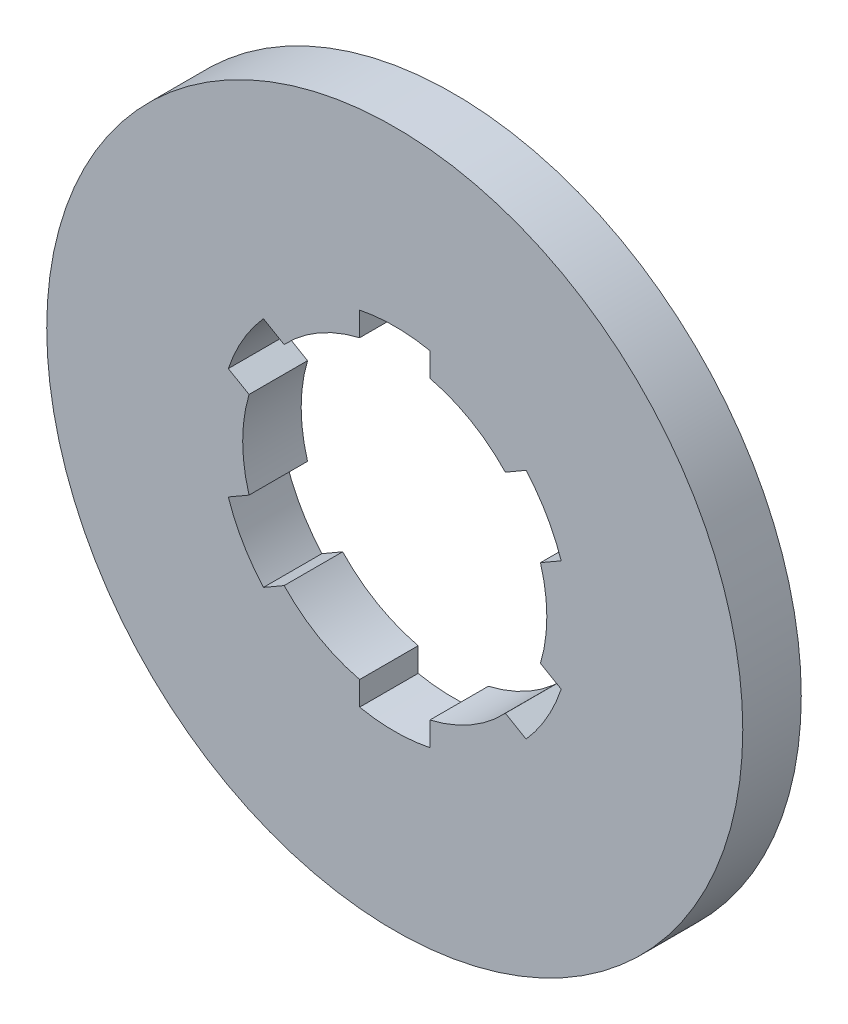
ISO-10303-21;
HEADER;
FILE_DESCRIPTION(('STEP AP214'),'2;1');
FILE_NAME('part.step','',(''),(''),'','','');
FILE_SCHEMA(('AUTOMOTIVE_DESIGN { 1 0 10303 214 1 1 1 1 }'));
ENDSEC;
DATA;
#1=APPLICATION_CONTEXT('core data for automotive mechanical design processes');
#2=APPLICATION_PROTOCOL_DEFINITION('international standard','automotive_design',2000,#1);
#3=PRODUCT_CONTEXT('',#1,'mechanical');
#4=PRODUCT('Part','Part','',(#3));
#5=PRODUCT_RELATED_PRODUCT_CATEGORY('part','',(#4));
#6=PRODUCT_DEFINITION_FORMATION('','',#4);
#7=PRODUCT_DEFINITION_CONTEXT('part definition',#1,'design');
#8=PRODUCT_DEFINITION('design','',#6,#7);
#9=PRODUCT_DEFINITION_SHAPE('','',#8);
#10=(LENGTH_UNIT() NAMED_UNIT(*) SI_UNIT(.MILLI.,.METRE.));
#11=(NAMED_UNIT(*) PLANE_ANGLE_UNIT() SI_UNIT($,.RADIAN.));
#12=(NAMED_UNIT(*) SI_UNIT($,.STERADIAN.) SOLID_ANGLE_UNIT());
#13=UNCERTAINTY_MEASURE_WITH_UNIT(LENGTH_MEASURE(1.E-05),#10,'distance_accuracy_value','');
#14=(GEOMETRIC_REPRESENTATION_CONTEXT(3) GLOBAL_UNCERTAINTY_ASSIGNED_CONTEXT((#13)) GLOBAL_UNIT_ASSIGNED_CONTEXT((#10,
#11,#12)) REPRESENTATION_CONTEXT('',''));
#15=CARTESIAN_POINT('',(0.,0.,0.));
#16=DIRECTION('',(0.,0.,1.));
#17=DIRECTION('',(1.,0.,0.));
#18=AXIS2_PLACEMENT_3D('',#15,#16,#17);
#19=CARTESIAN_POINT('',(0.,0.,-2.5));
#20=DIRECTION('',(0.,0.,1.));
#21=DIRECTION('',(1.,0.,0.));
#22=AXIS2_PLACEMENT_3D('',#19,#20,#21);
#23=CYLINDRICAL_SURFACE('',#22,13.);
#24=CARTESIAN_POINT('',(0.,0.,-2.5));
#25=DIRECTION('',(0.,0.,1.));
#26=DIRECTION('',(1.,0.,0.));
#27=AXIS2_PLACEMENT_3D('',#24,#25,#26);
#28=CIRCLE('',#27,13.);
#29=CARTESIAN_POINT('',(9.45445115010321,8.92263153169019,-2.5));
#30=VERTEX_POINT('',#29);
#31=CARTESIAN_POINT('',(3.,12.6491106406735,-2.5));
#32=VERTEX_POINT('',#31);
#33=EDGE_CURVE('E234',#30,#32,#28,.T.);
#34=ORIENTED_EDGE('',*,*,#33,.F.);
#35=DIRECTION('',(0.,0.,1.));
#36=VECTOR('',#35,1.);
#37=CARTESIAN_POINT('',(9.45445115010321,8.92263153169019,-2.5));
#38=LINE('',#37,#36);
#39=CARTESIAN_POINT('',(9.45445115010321,8.92263153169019,2.49999999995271));
#40=VERTEX_POINT('',#39);
#41=EDGE_CURVE('E337',#30,#40,#38,.T.);
#42=ORIENTED_EDGE('',*,*,#41,.T.);
#43=CARTESIAN_POINT('',(0.,0.,2.5));
#44=DIRECTION('',(0.,0.,1.));
#45=DIRECTION('',(1.,0.,0.));
#46=AXIS2_PLACEMENT_3D('',#43,#44,#45);
#47=CIRCLE('',#46,13.);
#48=CARTESIAN_POINT('',(3.,12.6491106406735,2.49999999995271));
#49=VERTEX_POINT('',#48);
#50=EDGE_CURVE('E225',#40,#49,#47,.T.);
#51=ORIENTED_EDGE('',*,*,#50,.T.);
#52=DIRECTION('',(0.,0.,1.));
#53=VECTOR('',#52,1.);
#54=CARTESIAN_POINT('',(3.,12.6491106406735,-2.5));
#55=LINE('',#54,#53);
#56=EDGE_CURVE('E236',#32,#49,#55,.T.);
#57=ORIENTED_EDGE('',*,*,#56,.F.);
#58=EDGE_LOOP('',(#34,#42,#51,#57));
#59=FACE_BOUND('',#58,.T.);
#60=ADVANCED_FACE('F36',(#59),#23,.F.);
#61=CARTESIAN_POINT('',(12.4544511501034,-3.72647910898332,2.49999999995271));
#62=VERTEX_POINT('',#61);
#63=CARTESIAN_POINT('',(12.4544511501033,3.72647910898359,2.49999999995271));
#64=VERTEX_POINT('',#63);
#65=EDGE_CURVE('E217',#62,#64,#47,.T.);
#66=ORIENTED_EDGE('',*,*,#65,.T.);
#67=DIRECTION('',(0.,0.,1.));
#68=VECTOR('',#67,1.);
#69=CARTESIAN_POINT('',(12.4544511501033,3.72647910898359,-2.5));
#70=LINE('',#69,#68);
#71=CARTESIAN_POINT('',(12.4544511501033,3.72647910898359,-2.5));
#72=VERTEX_POINT('',#71);
#73=EDGE_CURVE('E197',#72,#64,#70,.T.);
#74=ORIENTED_EDGE('',*,*,#73,.F.);
#75=CARTESIAN_POINT('',(12.4544511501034,-3.72647910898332,-2.5));
#76=VERTEX_POINT('',#75);
#77=EDGE_CURVE('E380',#76,#72,#28,.T.);
#78=ORIENTED_EDGE('',*,*,#77,.F.);
#79=DIRECTION('',(0.,0.,1.));
#80=VECTOR('',#79,1.);
#81=CARTESIAN_POINT('',(12.4544511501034,-3.72647910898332,-2.5));
#82=LINE('',#81,#80);
#83=EDGE_CURVE('E223',#76,#62,#82,.T.);
#84=ORIENTED_EDGE('',*,*,#83,.T.);
#85=EDGE_LOOP('',(#66,#74,#78,#84));
#86=FACE_BOUND('',#85,.T.);
#87=ADVANCED_FACE('F222',(#86),#23,.F.);
#88=CARTESIAN_POINT('',(3.00000000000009,-12.6491106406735,2.49999999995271));
#89=VERTEX_POINT('',#88);
#90=CARTESIAN_POINT('',(9.45445115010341,-8.92263153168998,2.49999999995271));
#91=VERTEX_POINT('',#90);
#92=EDGE_CURVE('E224',#89,#91,#47,.T.);
#93=ORIENTED_EDGE('',*,*,#92,.T.);
#94=DIRECTION('',(0.,0.,1.));
#95=VECTOR('',#94,1.);
#96=CARTESIAN_POINT('',(9.45445115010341,-8.92263153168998,-2.5));
#97=LINE('',#96,#95);
#98=CARTESIAN_POINT('',(9.45445115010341,-8.92263153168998,-2.5));
#99=VERTEX_POINT('',#98);
#100=EDGE_CURVE('E466',#99,#91,#97,.T.);
#101=ORIENTED_EDGE('',*,*,#100,.F.);
#102=CARTESIAN_POINT('',(3.00000000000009,-12.6491106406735,-2.5));
#103=VERTEX_POINT('',#102);
#104=EDGE_CURVE('E381',#103,#99,#28,.T.);
#105=ORIENTED_EDGE('',*,*,#104,.F.);
#106=DIRECTION('',(0.,0.,1.));
#107=VECTOR('',#106,1.);
#108=CARTESIAN_POINT('',(3.00000000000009,-12.6491106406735,-2.5));
#109=LINE('',#108,#107);
#110=EDGE_CURVE('E477',#103,#89,#109,.T.);
#111=ORIENTED_EDGE('',*,*,#110,.T.);
#112=EDGE_LOOP('',(#93,#101,#105,#111));
#113=FACE_BOUND('',#112,.T.);
#114=ADVANCED_FACE('F263',(#113),#23,.F.);
#115=CARTESIAN_POINT('',(-9.45445115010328,-8.92263153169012,2.49999999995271));
#116=VERTEX_POINT('',#115);
#117=CARTESIAN_POINT('',(-2.99999999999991,-12.6491106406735,2.49999999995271));
#118=VERTEX_POINT('',#117);
#119=EDGE_CURVE('E228',#116,#118,#47,.T.);
#120=ORIENTED_EDGE('',*,*,#119,.T.);
#121=DIRECTION('',(0.,0.,1.));
#122=VECTOR('',#121,1.);
#123=CARTESIAN_POINT('',(-2.99999999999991,-12.6491106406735,-2.5));
#124=LINE('',#123,#122);
#125=CARTESIAN_POINT('',(-2.99999999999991,-12.6491106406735,-2.5));
#126=VERTEX_POINT('',#125);
#127=EDGE_CURVE('E449',#126,#118,#124,.T.);
#128=ORIENTED_EDGE('',*,*,#127,.F.);
#129=CARTESIAN_POINT('',(-9.45445115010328,-8.92263153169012,-2.5));
#130=VERTEX_POINT('',#129);
#131=EDGE_CURVE('E384',#130,#126,#28,.T.);
#132=ORIENTED_EDGE('',*,*,#131,.F.);
#133=DIRECTION('',(0.,0.,1.));
#134=VECTOR('',#133,1.);
#135=CARTESIAN_POINT('',(-9.45445115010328,-8.92263153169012,-2.5));
#136=LINE('',#135,#134);
#137=EDGE_CURVE('E421',#130,#116,#136,.T.);
#138=ORIENTED_EDGE('',*,*,#137,.T.);
#139=EDGE_LOOP('',(#120,#128,#132,#138));
#140=FACE_BOUND('',#139,.T.);
#141=ADVANCED_FACE('F448',(#140),#23,.F.);
#142=CARTESIAN_POINT('',(-12.4544511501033,3.72647910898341,2.49999999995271));
#143=VERTEX_POINT('',#142);
#144=CARTESIAN_POINT('',(-12.4544511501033,-3.7264791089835,2.49999999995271));
#145=VERTEX_POINT('',#144);
#146=EDGE_CURVE('E235',#143,#145,#47,.T.);
#147=ORIENTED_EDGE('',*,*,#146,.T.);
#148=DIRECTION('',(0.,0.,1.));
#149=VECTOR('',#148,1.);
#150=CARTESIAN_POINT('',(-12.4544511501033,-3.7264791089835,-2.5));
#151=LINE('',#150,#149);
#152=CARTESIAN_POINT('',(-12.4544511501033,-3.7264791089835,-2.5));
#153=VERTEX_POINT('',#152);
#154=EDGE_CURVE('E405',#153,#145,#151,.T.);
#155=ORIENTED_EDGE('',*,*,#154,.F.);
#156=CARTESIAN_POINT('',(-12.4544511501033,3.72647910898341,-2.5));
#157=VERTEX_POINT('',#156);
#158=EDGE_CURVE('E240',#157,#153,#28,.T.);
#159=ORIENTED_EDGE('',*,*,#158,.F.);
#160=DIRECTION('',(0.,0.,1.));
#161=VECTOR('',#160,1.);
#162=CARTESIAN_POINT('',(-12.4544511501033,3.72647910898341,-2.5));
#163=LINE('',#162,#161);
#164=EDGE_CURVE('E353',#157,#143,#163,.T.);
#165=ORIENTED_EDGE('',*,*,#164,.T.);
#166=EDGE_LOOP('',(#147,#155,#159,#165));
#167=FACE_BOUND('',#166,.T.);
#168=ADVANCED_FACE('F257',(#167),#23,.F.);
#169=CARTESIAN_POINT('',(0.,0.,2.5));
#170=DIRECTION('',(0.,0.,-1.));
#171=DIRECTION('',(-1.,0.,0.));
#172=AXIS2_PLACEMENT_3D('',#169,#170,#171);
#173=CYLINDRICAL_SURFACE('',#172,29.75);
#174=CARTESIAN_POINT('',(0.,0.,2.5));
#175=DIRECTION('',(0.,0.,1.));
#176=DIRECTION('',(1.,0.,0.));
#177=AXIS2_PLACEMENT_3D('',#174,#175,#176);
#178=CIRCLE('',#177,29.75);
#179=CARTESIAN_POINT('',(29.75,0.,2.5));
#180=VERTEX_POINT('',#179);
#181=EDGE_CURVE('E11',#180,#180,#178,.T.);
#182=ORIENTED_EDGE('',*,*,#181,.F.);
#183=EDGE_LOOP('',(#182));
#184=FACE_BOUND('',#183,.T.);
#185=CARTESIAN_POINT('',(0.,0.,-2.5));
#186=DIRECTION('',(0.,0.,1.));
#187=DIRECTION('',(1.,0.,0.));
#188=AXIS2_PLACEMENT_3D('',#185,#186,#187);
#189=CIRCLE('',#188,29.75);
#190=CARTESIAN_POINT('',(29.75,0.,-2.5));
#191=VERTEX_POINT('',#190);
#192=EDGE_CURVE('E44',#191,#191,#189,.T.);
#193=ORIENTED_EDGE('',*,*,#192,.T.);
#194=EDGE_LOOP('',(#193));
#195=FACE_BOUND('',#194,.T.);
#196=ADVANCED_FACE('F38',(#184,#195),#173,.T.);
#197=CARTESIAN_POINT('',(0.,0.,2.5));
#198=DIRECTION('',(0.,0.,1.));
#199=DIRECTION('',(1.,0.,0.));
#200=AXIS2_PLACEMENT_3D('',#197,#198,#199);
#201=PLANE('',#200);
#202=DIRECTION('',(-0.866025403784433,-0.50000000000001,0.));
#203=VECTOR('',#202,1.);
#204=CARTESIAN_POINT('',(11.2279220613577,9.94654543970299,2.49999999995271));
#205=LINE('',#204,#203);
#206=CARTESIAN_POINT('',(11.2279220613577,9.94654543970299,2.49999999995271));
#207=VERTEX_POINT('',#206);
#208=EDGE_CURVE('E334',#207,#40,#205,.T.);
#209=ORIENTED_EDGE('',*,*,#208,.F.);
#210=CARTESIAN_POINT('',(0.,0.,2.49999999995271));
#211=DIRECTION('',(0.,0.,1.));
#212=DIRECTION('',(0.50000000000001,-0.866025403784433,0.));
#213=AXIS2_PLACEMENT_3D('',#210,#211,#212);
#214=CIRCLE('',#213,15.);
#215=CARTESIAN_POINT('',(14.2279220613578,4.75039301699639,2.49999999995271));
#216=VERTEX_POINT('',#215);
#217=EDGE_CURVE('E219',#216,#207,#214,.T.);
#218=ORIENTED_EDGE('',*,*,#217,.F.);
#219=DIRECTION('',(0.866025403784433,0.50000000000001,0.));
#220=VECTOR('',#219,1.);
#221=CARTESIAN_POINT('',(12.4544511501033,3.72647910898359,2.49999999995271));
#222=LINE('',#221,#220);
#223=EDGE_CURVE('E200',#64,#216,#222,.T.);
#224=ORIENTED_EDGE('',*,*,#223,.F.);
#225=ORIENTED_EDGE('',*,*,#65,.F.);
#226=DIRECTION('',(-0.866025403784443,0.499999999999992,0.));
#227=VECTOR('',#226,1.);
#228=CARTESIAN_POINT('',(14.2279220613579,-4.75039301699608,2.49999999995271));
#229=LINE('',#228,#227);
#230=CARTESIAN_POINT('',(14.2279220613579,-4.75039301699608,2.49999999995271));
#231=VERTEX_POINT('',#230);
#232=EDGE_CURVE('E504',#231,#62,#229,.T.);
#233=ORIENTED_EDGE('',*,*,#232,.F.);
#234=CARTESIAN_POINT('',(0.,0.,2.49999999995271));
#235=DIRECTION('',(0.,0.,1.));
#236=DIRECTION('',(-0.499999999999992,-0.866025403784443,0.));
#237=AXIS2_PLACEMENT_3D('',#234,#235,#236);
#238=CIRCLE('',#237,15.);
#239=CARTESIAN_POINT('',(11.2279220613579,-9.94654543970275,2.49999999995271));
#240=VERTEX_POINT('',#239);
#241=EDGE_CURVE('E502',#240,#231,#238,.T.);
#242=ORIENTED_EDGE('',*,*,#241,.F.);
#243=DIRECTION('',(0.866025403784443,-0.499999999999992,0.));
#244=VECTOR('',#243,1.);
#245=CARTESIAN_POINT('',(9.45445115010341,-8.92263153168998,2.49999999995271));
#246=LINE('',#245,#244);
#247=EDGE_CURVE('E344',#91,#240,#246,.T.);
#248=ORIENTED_EDGE('',*,*,#247,.F.);
#249=ORIENTED_EDGE('',*,*,#92,.F.);
#250=DIRECTION('',(0.,1.,0.));
#251=VECTOR('',#250,1.);
#252=CARTESIAN_POINT('',(3.00000000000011,-14.696938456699,2.49999999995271));
#253=LINE('',#252,#251);
#254=CARTESIAN_POINT('',(3.00000000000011,-14.696938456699,2.49999999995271));
#255=VERTEX_POINT('',#254);
#256=EDGE_CURVE('E461',#255,#89,#253,.T.);
#257=ORIENTED_EDGE('',*,*,#256,.F.);
#258=CARTESIAN_POINT('',(0.,0.,2.49999999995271));
#259=DIRECTION('',(0.,0.,1.));
#260=DIRECTION('',(-1.,0.,0.));
#261=AXIS2_PLACEMENT_3D('',#258,#259,#260);
#262=CIRCLE('',#261,15.);
#263=CARTESIAN_POINT('',(-2.9999999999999,-14.6969384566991,2.49999999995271));
#264=VERTEX_POINT('',#263);
#265=EDGE_CURVE('E458',#264,#255,#262,.T.);
#266=ORIENTED_EDGE('',*,*,#265,.F.);
#267=DIRECTION('',(0.,-1.,0.));
#268=VECTOR('',#267,1.);
#269=CARTESIAN_POINT('',(-2.99999999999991,-12.6491106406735,2.49999999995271));
#270=LINE('',#269,#268);
#271=EDGE_CURVE('E455',#118,#264,#270,.T.);
#272=ORIENTED_EDGE('',*,*,#271,.F.);
#273=ORIENTED_EDGE('',*,*,#119,.F.);
#274=DIRECTION('',(0.866025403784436,0.500000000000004,0.));
#275=VECTOR('',#274,1.);
#276=CARTESIAN_POINT('',(-11.2279220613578,-9.94654543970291,2.49999999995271));
#277=LINE('',#276,#275);
#278=CARTESIAN_POINT('',(-11.2279220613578,-9.94654543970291,2.49999999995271));
#279=VERTEX_POINT('',#278);
#280=EDGE_CURVE('E452',#279,#116,#277,.T.);
#281=ORIENTED_EDGE('',*,*,#280,.F.);
#282=CARTESIAN_POINT('',(0.,0.,2.49999999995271));
#283=DIRECTION('',(0.,0.,1.));
#284=DIRECTION('',(-0.500000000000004,0.866025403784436,0.));
#285=AXIS2_PLACEMENT_3D('',#282,#283,#284);
#286=CIRCLE('',#285,15.);
#287=CARTESIAN_POINT('',(-14.2279220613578,-4.75039301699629,2.49999999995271));
#288=VERTEX_POINT('',#287);
#289=EDGE_CURVE('E486',#288,#279,#286,.T.);
#290=ORIENTED_EDGE('',*,*,#289,.F.);
#291=DIRECTION('',(-0.866025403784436,-0.500000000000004,0.));
#292=VECTOR('',#291,1.);
#293=CARTESIAN_POINT('',(-12.4544511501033,-3.7264791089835,2.49999999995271));
#294=LINE('',#293,#292);
#295=EDGE_CURVE('E442',#145,#288,#294,.T.);
#296=ORIENTED_EDGE('',*,*,#295,.F.);
#297=ORIENTED_EDGE('',*,*,#146,.F.);
#298=DIRECTION('',(0.86602540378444,-0.499999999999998,0.));
#299=VECTOR('',#298,1.);
#300=CARTESIAN_POINT('',(-14.2279220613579,4.75039301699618,2.49999999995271));
#301=LINE('',#300,#299);
#302=CARTESIAN_POINT('',(-14.2279220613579,4.75039301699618,2.49999999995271));
#303=VERTEX_POINT('',#302);
#304=EDGE_CURVE('E424',#303,#143,#301,.T.);
#305=ORIENTED_EDGE('',*,*,#304,.F.);
#306=CARTESIAN_POINT('',(0.,0.,2.49999999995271));
#307=DIRECTION('',(0.,0.,1.));
#308=DIRECTION('',(0.499999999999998,0.86602540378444,0.));
#309=AXIS2_PLACEMENT_3D('',#306,#307,#308);
#310=CIRCLE('',#309,15.);
#311=CARTESIAN_POINT('',(-11.2279220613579,9.94654543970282,2.49999999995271));
#312=VERTEX_POINT('',#311);
#313=EDGE_CURVE('E420',#312,#303,#310,.T.);
#314=ORIENTED_EDGE('',*,*,#313,.F.);
#315=DIRECTION('',(-0.86602540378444,0.499999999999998,0.));
#316=VECTOR('',#315,1.);
#317=CARTESIAN_POINT('',(-9.45445115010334,8.92263153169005,2.49999999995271));
#318=LINE('',#317,#316);
#319=CARTESIAN_POINT('',(-9.45445115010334,8.92263153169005,2.49999999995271));
#320=VERTEX_POINT('',#319);
#321=EDGE_CURVE('E417',#320,#312,#318,.T.);
#322=ORIENTED_EDGE('',*,*,#321,.F.);
#323=CARTESIAN_POINT('',(-3.,12.6491106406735,2.49999999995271));
#324=VERTEX_POINT('',#323);
#325=EDGE_CURVE('E230',#324,#320,#47,.T.);
#326=ORIENTED_EDGE('',*,*,#325,.F.);
#327=DIRECTION('',(0.,-1.,0.));
#328=VECTOR('',#327,1.);
#329=CARTESIAN_POINT('',(-3.,14.6969384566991,2.49999999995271));
#330=LINE('',#329,#328);
#331=CARTESIAN_POINT('',(-3.,14.6969384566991,2.49999999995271));
#332=VERTEX_POINT('',#331);
#333=EDGE_CURVE('E355',#332,#324,#330,.T.);
#334=ORIENTED_EDGE('',*,*,#333,.F.);
#335=CARTESIAN_POINT('',(0.,0.,2.49999999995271));
#336=DIRECTION('',(0.,0.,1.));
#337=DIRECTION('',(1.,0.,0.));
#338=AXIS2_PLACEMENT_3D('',#335,#336,#337);
#339=CIRCLE('',#338,15.);
#340=CARTESIAN_POINT('',(3.,14.6969384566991,2.49999999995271));
#341=VERTEX_POINT('',#340);
#342=EDGE_CURVE('E352',#341,#332,#339,.T.);
#343=ORIENTED_EDGE('',*,*,#342,.F.);
#344=DIRECTION('',(0.,1.,0.));
#345=VECTOR('',#344,1.);
#346=CARTESIAN_POINT('',(3.,12.6491106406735,2.49999999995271));
#347=LINE('',#346,#345);
#348=EDGE_CURVE('E349',#49,#341,#347,.T.);
#349=ORIENTED_EDGE('',*,*,#348,.F.);
#350=ORIENTED_EDGE('',*,*,#50,.F.);
#351=EDGE_LOOP('',(#209,#218,#224,#225,#233,#242,#248,#249,#257,#266,#272,#273,#281,#290,#296,
#297,#305,#314,#322,#326,#334,#343,#349,#350));
#352=FACE_BOUND('',#351,.T.);
#353=ORIENTED_EDGE('',*,*,#181,.T.);
#354=EDGE_LOOP('',(#353));
#355=FACE_BOUND('',#354,.T.);
#356=ADVANCED_FACE('F214',(#352,#355),#201,.T.);
#357=CARTESIAN_POINT('',(0.,0.,-2.5));
#358=DIRECTION('',(0.,0.,1.));
#359=DIRECTION('',(1.,0.,0.));
#360=AXIS2_PLACEMENT_3D('',#357,#358,#359);
#361=PLANE('',#360);
#362=CARTESIAN_POINT('',(0.,0.,-2.5));
#363=DIRECTION('',(0.,0.,1.));
#364=DIRECTION('',(0.50000000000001,-0.866025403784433,0.));
#365=AXIS2_PLACEMENT_3D('',#362,#363,#364);
#366=CIRCLE('',#365,15.);
#367=CARTESIAN_POINT('',(14.2279220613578,4.75039301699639,-2.5));
#368=VERTEX_POINT('',#367);
#369=CARTESIAN_POINT('',(11.2279220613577,9.94654543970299,-2.5));
#370=VERTEX_POINT('',#369);
#371=EDGE_CURVE('E51',#368,#370,#366,.T.);
#372=ORIENTED_EDGE('',*,*,#371,.T.);
#373=DIRECTION('',(-0.866025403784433,-0.50000000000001,0.));
#374=VECTOR('',#373,1.);
#375=CARTESIAN_POINT('',(11.2279220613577,9.94654543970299,-2.5));
#376=LINE('',#375,#374);
#377=EDGE_CURVE('E209',#370,#30,#376,.T.);
#378=ORIENTED_EDGE('',*,*,#377,.T.);
#379=ORIENTED_EDGE('',*,*,#33,.T.);
#380=DIRECTION('',(0.,1.,0.));
#381=VECTOR('',#380,1.);
#382=CARTESIAN_POINT('',(3.,12.6491106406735,-2.5));
#383=LINE('',#382,#381);
#384=CARTESIAN_POINT('',(3.,14.6969384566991,-2.5));
#385=VERTEX_POINT('',#384);
#386=EDGE_CURVE('E365',#32,#385,#383,.T.);
#387=ORIENTED_EDGE('',*,*,#386,.T.);
#388=CARTESIAN_POINT('',(0.,0.,-2.5));
#389=DIRECTION('',(0.,0.,1.));
#390=DIRECTION('',(1.,0.,0.));
#391=AXIS2_PLACEMENT_3D('',#388,#389,#390);
#392=CIRCLE('',#391,15.);
#393=CARTESIAN_POINT('',(-3.,14.6969384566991,-2.5));
#394=VERTEX_POINT('',#393);
#395=EDGE_CURVE('E368',#385,#394,#392,.T.);
#396=ORIENTED_EDGE('',*,*,#395,.T.);
#397=DIRECTION('',(0.,-1.,0.));
#398=VECTOR('',#397,1.);
#399=CARTESIAN_POINT('',(-3.,14.6969384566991,-2.5));
#400=LINE('',#399,#398);
#401=CARTESIAN_POINT('',(-3.,12.6491106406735,-2.5));
#402=VERTEX_POINT('',#401);
#403=EDGE_CURVE('E371',#394,#402,#400,.T.);
#404=ORIENTED_EDGE('',*,*,#403,.T.);
#405=CARTESIAN_POINT('',(-9.45445115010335,8.92263153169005,-2.5));
#406=VERTEX_POINT('',#405);
#407=EDGE_CURVE('E238',#402,#406,#28,.T.);
#408=ORIENTED_EDGE('',*,*,#407,.T.);
#409=DIRECTION('',(-0.86602540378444,0.499999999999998,0.));
#410=VECTOR('',#409,1.);
#411=CARTESIAN_POINT('',(-9.45445115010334,8.92263153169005,-2.5));
#412=LINE('',#411,#410);
#413=CARTESIAN_POINT('',(-11.2279220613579,9.94654543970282,-2.5));
#414=VERTEX_POINT('',#413);
#415=EDGE_CURVE('E426',#406,#414,#412,.T.);
#416=ORIENTED_EDGE('',*,*,#415,.T.);
#417=CARTESIAN_POINT('',(0.,0.,-2.5));
#418=DIRECTION('',(0.,0.,1.));
#419=DIRECTION('',(0.499999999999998,0.86602540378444,0.));
#420=AXIS2_PLACEMENT_3D('',#417,#418,#419);
#421=CIRCLE('',#420,15.);
#422=CARTESIAN_POINT('',(-14.2279220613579,4.75039301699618,-2.5));
#423=VERTEX_POINT('',#422);
#424=EDGE_CURVE('E429',#414,#423,#421,.T.);
#425=ORIENTED_EDGE('',*,*,#424,.T.);
#426=DIRECTION('',(0.86602540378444,-0.499999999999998,0.));
#427=VECTOR('',#426,1.);
#428=CARTESIAN_POINT('',(-14.2279220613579,4.75039301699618,-2.5));
#429=LINE('',#428,#427);
#430=EDGE_CURVE('E400',#423,#157,#429,.T.);
#431=ORIENTED_EDGE('',*,*,#430,.T.);
#432=ORIENTED_EDGE('',*,*,#158,.T.);
#433=DIRECTION('',(-0.866025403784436,-0.500000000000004,0.));
#434=VECTOR('',#433,1.);
#435=CARTESIAN_POINT('',(-12.4544511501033,-3.7264791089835,-2.5));
#436=LINE('',#435,#434);
#437=CARTESIAN_POINT('',(-14.2279220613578,-4.75039301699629,-2.5));
#438=VERTEX_POINT('',#437);
#439=EDGE_CURVE('E397',#153,#438,#436,.T.);
#440=ORIENTED_EDGE('',*,*,#439,.T.);
#441=CARTESIAN_POINT('',(0.,0.,-2.5));
#442=DIRECTION('',(0.,0.,1.));
#443=DIRECTION('',(-0.500000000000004,0.866025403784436,0.));
#444=AXIS2_PLACEMENT_3D('',#441,#442,#443);
#445=CIRCLE('',#444,15.);
#446=CARTESIAN_POINT('',(-11.2279220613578,-9.94654543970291,-2.5));
#447=VERTEX_POINT('',#446);
#448=EDGE_CURVE('E413',#438,#447,#445,.T.);
#449=ORIENTED_EDGE('',*,*,#448,.T.);
#450=DIRECTION('',(0.866025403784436,0.500000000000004,0.));
#451=VECTOR('',#450,1.);
#452=CARTESIAN_POINT('',(-11.2279220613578,-9.94654543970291,-2.5));
#453=LINE('',#452,#451);
#454=EDGE_CURVE('E409',#447,#130,#453,.T.);
#455=ORIENTED_EDGE('',*,*,#454,.T.);
#456=ORIENTED_EDGE('',*,*,#131,.T.);
#457=DIRECTION('',(0.,-1.,0.));
#458=VECTOR('',#457,1.);
#459=CARTESIAN_POINT('',(-2.99999999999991,-12.6491106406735,-2.5));
#460=LINE('',#459,#458);
#461=CARTESIAN_POINT('',(-2.99999999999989,-14.6969384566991,-2.5));
#462=VERTEX_POINT('',#461);
#463=EDGE_CURVE('E470',#126,#462,#460,.T.);
#464=ORIENTED_EDGE('',*,*,#463,.T.);
#465=CARTESIAN_POINT('',(0.,0.,-2.5));
#466=DIRECTION('',(0.,0.,1.));
#467=DIRECTION('',(-1.,0.,0.));
#468=AXIS2_PLACEMENT_3D('',#465,#466,#467);
#469=CIRCLE('',#468,15.);
#470=CARTESIAN_POINT('',(3.00000000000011,-14.696938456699,-2.5));
#471=VERTEX_POINT('',#470);
#472=EDGE_CURVE('E472',#462,#471,#469,.T.);
#473=ORIENTED_EDGE('',*,*,#472,.T.);
#474=DIRECTION('',(0.,1.,0.));
#475=VECTOR('',#474,1.);
#476=CARTESIAN_POINT('',(3.00000000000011,-14.696938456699,-2.5));
#477=LINE('',#476,#475);
#478=EDGE_CURVE('E475',#471,#103,#477,.T.);
#479=ORIENTED_EDGE('',*,*,#478,.T.);
#480=ORIENTED_EDGE('',*,*,#104,.T.);
#481=DIRECTION('',(0.866025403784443,-0.499999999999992,0.));
#482=VECTOR('',#481,1.);
#483=CARTESIAN_POINT('',(9.45445115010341,-8.92263153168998,-2.5));
#484=LINE('',#483,#482);
#485=CARTESIAN_POINT('',(11.2279220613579,-9.94654543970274,-2.5));
#486=VERTEX_POINT('',#485);
#487=EDGE_CURVE('E509',#99,#486,#484,.T.);
#488=ORIENTED_EDGE('',*,*,#487,.T.);
#489=CARTESIAN_POINT('',(0.,0.,-2.5));
#490=DIRECTION('',(0.,0.,1.));
#491=DIRECTION('',(-0.499999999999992,-0.866025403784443,0.));
#492=AXIS2_PLACEMENT_3D('',#489,#490,#491);
#493=CIRCLE('',#492,15.);
#494=CARTESIAN_POINT('',(14.2279220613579,-4.75039301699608,-2.5));
#495=VERTEX_POINT('',#494);
#496=EDGE_CURVE('E59',#486,#495,#493,.T.);
#497=ORIENTED_EDGE('',*,*,#496,.T.);
#498=DIRECTION('',(-0.866025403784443,0.499999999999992,0.));
#499=VECTOR('',#498,1.);
#500=CARTESIAN_POINT('',(14.2279220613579,-4.75039301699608,-2.5));
#501=LINE('',#500,#499);
#502=EDGE_CURVE('E512',#495,#76,#501,.T.);
#503=ORIENTED_EDGE('',*,*,#502,.T.);
#504=ORIENTED_EDGE('',*,*,#77,.T.);
#505=DIRECTION('',(0.866025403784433,0.50000000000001,0.));
#506=VECTOR('',#505,1.);
#507=CARTESIAN_POINT('',(12.4544511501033,3.72647910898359,-2.5));
#508=LINE('',#507,#506);
#509=EDGE_CURVE('E203',#72,#368,#508,.T.);
#510=ORIENTED_EDGE('',*,*,#509,.T.);
#511=EDGE_LOOP('',(#372,#378,#379,#387,#396,#404,#408,#416,#425,#431,#432,#440,#449,#455,#456,
#464,#473,#479,#480,#488,#497,#503,#504,#510));
#512=FACE_BOUND('',#511,.T.);
#513=ORIENTED_EDGE('',*,*,#192,.F.);
#514=EDGE_LOOP('',(#513));
#515=FACE_BOUND('',#514,.T.);
#516=ADVANCED_FACE('F245',(#512,#515),#361,.F.);
#517=ORIENTED_EDGE('',*,*,#325,.T.);
#518=DIRECTION('',(0.,0.,1.));
#519=VECTOR('',#518,1.);
#520=CARTESIAN_POINT('',(-9.45445115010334,8.92263153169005,-2.5));
#521=LINE('',#520,#519);
#522=EDGE_CURVE('E361',#406,#320,#521,.T.);
#523=ORIENTED_EDGE('',*,*,#522,.F.);
#524=ORIENTED_EDGE('',*,*,#407,.F.);
#525=DIRECTION('',(0.,0.,1.));
#526=VECTOR('',#525,1.);
#527=CARTESIAN_POINT('',(-3.,12.6491106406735,-2.5));
#528=LINE('',#527,#526);
#529=EDGE_CURVE('E229',#402,#324,#528,.T.);
#530=ORIENTED_EDGE('',*,*,#529,.T.);
#531=EDGE_LOOP('',(#517,#523,#524,#530));
#532=FACE_BOUND('',#531,.T.);
#533=ADVANCED_FACE('F247',(#532),#23,.F.);
#534=CARTESIAN_POINT('',(-3.,14.6969384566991,-2.5));
#535=DIRECTION('',(-1.,0.,0.));
#536=DIRECTION('',(0.,0.,1.));
#537=AXIS2_PLACEMENT_3D('',#534,#535,#536);
#538=PLANE('',#537);
#539=ORIENTED_EDGE('',*,*,#333,.T.);
#540=ORIENTED_EDGE('',*,*,#529,.F.);
#541=ORIENTED_EDGE('',*,*,#403,.F.);
#542=DIRECTION('',(0.,0.,1.));
#543=VECTOR('',#542,1.);
#544=CARTESIAN_POINT('',(-3.,14.6969384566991,-2.5));
#545=LINE('',#544,#543);
#546=EDGE_CURVE('E376',#394,#332,#545,.T.);
#547=ORIENTED_EDGE('',*,*,#546,.T.);
#548=EDGE_LOOP('',(#539,#540,#541,#547));
#549=FACE_BOUND('',#548,.T.);
#550=ADVANCED_FACE('F254',(#549),#538,.F.);
#551=CARTESIAN_POINT('',(0.,0.,-2.5));
#552=DIRECTION('',(0.,0.,1.));
#553=DIRECTION('',(1.,0.,0.));
#554=AXIS2_PLACEMENT_3D('',#551,#552,#553);
#555=CYLINDRICAL_SURFACE('',#554,15.);
#556=ORIENTED_EDGE('',*,*,#342,.T.);
#557=ORIENTED_EDGE('',*,*,#546,.F.);
#558=ORIENTED_EDGE('',*,*,#395,.F.);
#559=DIRECTION('',(0.,0.,1.));
#560=VECTOR('',#559,1.);
#561=CARTESIAN_POINT('',(3.,14.6969384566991,-2.5));
#562=LINE('',#561,#560);
#563=EDGE_CURVE('E377',#385,#341,#562,.T.);
#564=ORIENTED_EDGE('',*,*,#563,.T.);
#565=EDGE_LOOP('',(#556,#557,#558,#564));
#566=FACE_BOUND('',#565,.T.);
#567=ADVANCED_FACE('F270',(#566),#555,.F.);
#568=CARTESIAN_POINT('',(3.,12.6491106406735,-2.5));
#569=DIRECTION('',(1.,0.,0.));
#570=DIRECTION('',(0.,0.,-1.));
#571=AXIS2_PLACEMENT_3D('',#568,#569,#570);
#572=PLANE('',#571);
#573=ORIENTED_EDGE('',*,*,#348,.T.);
#574=ORIENTED_EDGE('',*,*,#563,.F.);
#575=ORIENTED_EDGE('',*,*,#386,.F.);
#576=ORIENTED_EDGE('',*,*,#56,.T.);
#577=EDGE_LOOP('',(#573,#574,#575,#576));
#578=FACE_BOUND('',#577,.T.);
#579=ADVANCED_FACE('F266',(#578),#572,.F.);
#580=CARTESIAN_POINT('',(-14.2279220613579,4.75039301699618,-2.5));
#581=DIRECTION('',(-0.499999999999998,-0.86602540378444,0.));
#582=DIRECTION('',(0.86602540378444,-0.499999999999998,0.));
#583=AXIS2_PLACEMENT_3D('',#580,#581,#582);
#584=PLANE('',#583);
#585=ORIENTED_EDGE('',*,*,#304,.T.);
#586=ORIENTED_EDGE('',*,*,#164,.F.);
#587=ORIENTED_EDGE('',*,*,#430,.F.);
#588=DIRECTION('',(0.,0.,1.));
#589=VECTOR('',#588,1.);
#590=CARTESIAN_POINT('',(-14.2279220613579,4.75039301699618,-2.5));
#591=LINE('',#590,#589);
#592=EDGE_CURVE('E358',#423,#303,#591,.T.);
#593=ORIENTED_EDGE('',*,*,#592,.T.);
#594=EDGE_LOOP('',(#585,#586,#587,#593));
#595=FACE_BOUND('',#594,.T.);
#596=ADVANCED_FACE('F269',(#595),#584,.F.);
#597=CARTESIAN_POINT('',(0.,0.,-2.5));
#598=DIRECTION('',(0.,0.,1.));
#599=DIRECTION('',(1.,0.,0.));
#600=AXIS2_PLACEMENT_3D('',#597,#598,#599);
#601=CYLINDRICAL_SURFACE('',#600,15.);
#602=ORIENTED_EDGE('',*,*,#313,.T.);
#603=ORIENTED_EDGE('',*,*,#592,.F.);
#604=ORIENTED_EDGE('',*,*,#424,.F.);
#605=DIRECTION('',(0.,0.,1.));
#606=VECTOR('',#605,1.);
#607=CARTESIAN_POINT('',(-11.2279220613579,9.94654543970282,-2.5));
#608=LINE('',#607,#606);
#609=EDGE_CURVE('E432',#414,#312,#608,.T.);
#610=ORIENTED_EDGE('',*,*,#609,.T.);
#611=EDGE_LOOP('',(#602,#603,#604,#610));
#612=FACE_BOUND('',#611,.T.);
#613=ADVANCED_FACE('F282',(#612),#601,.F.);
#614=CARTESIAN_POINT('',(-9.45445115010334,8.92263153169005,-2.5));
#615=DIRECTION('',(0.499999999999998,0.86602540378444,0.));
#616=DIRECTION('',(-0.86602540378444,0.499999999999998,0.));
#617=AXIS2_PLACEMENT_3D('',#614,#615,#616);
#618=PLANE('',#617);
#619=ORIENTED_EDGE('',*,*,#321,.T.);
#620=ORIENTED_EDGE('',*,*,#609,.F.);
#621=ORIENTED_EDGE('',*,*,#415,.F.);
#622=ORIENTED_EDGE('',*,*,#522,.T.);
#623=EDGE_LOOP('',(#619,#620,#621,#622));
#624=FACE_BOUND('',#623,.T.);
#625=ADVANCED_FACE('F278',(#624),#618,.F.);
#626=CARTESIAN_POINT('',(-11.2279220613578,-9.94654543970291,-2.5));
#627=DIRECTION('',(0.500000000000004,-0.866025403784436,0.));
#628=DIRECTION('',(0.866025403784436,0.500000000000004,0.));
#629=AXIS2_PLACEMENT_3D('',#626,#627,#628);
#630=PLANE('',#629);
#631=ORIENTED_EDGE('',*,*,#280,.T.);
#632=ORIENTED_EDGE('',*,*,#137,.F.);
#633=ORIENTED_EDGE('',*,*,#454,.F.);
#634=DIRECTION('',(0.,0.,1.));
#635=VECTOR('',#634,1.);
#636=CARTESIAN_POINT('',(-11.2279220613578,-9.94654543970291,-2.5));
#637=LINE('',#636,#635);
#638=EDGE_CURVE('E411',#447,#279,#637,.T.);
#639=ORIENTED_EDGE('',*,*,#638,.T.);
#640=EDGE_LOOP('',(#631,#632,#633,#639));
#641=FACE_BOUND('',#640,.T.);
#642=ADVANCED_FACE('F281',(#641),#630,.F.);
#643=CARTESIAN_POINT('',(0.,0.,-2.5));
#644=DIRECTION('',(0.,0.,1.));
#645=DIRECTION('',(1.,0.,0.));
#646=AXIS2_PLACEMENT_3D('',#643,#644,#645);
#647=CYLINDRICAL_SURFACE('',#646,15.);
#648=ORIENTED_EDGE('',*,*,#289,.T.);
#649=ORIENTED_EDGE('',*,*,#638,.F.);
#650=ORIENTED_EDGE('',*,*,#448,.F.);
#651=DIRECTION('',(0.,0.,1.));
#652=VECTOR('',#651,1.);
#653=CARTESIAN_POINT('',(-14.2279220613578,-4.75039301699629,-2.5));
#654=LINE('',#653,#652);
#655=EDGE_CURVE('E408',#438,#288,#654,.T.);
#656=ORIENTED_EDGE('',*,*,#655,.T.);
#657=EDGE_LOOP('',(#648,#649,#650,#656));
#658=FACE_BOUND('',#657,.T.);
#659=ADVANCED_FACE('F294',(#658),#647,.F.);
#660=CARTESIAN_POINT('',(-12.4544511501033,-3.7264791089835,-2.5));
#661=DIRECTION('',(-0.500000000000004,0.866025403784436,0.));
#662=DIRECTION('',(-0.866025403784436,-0.500000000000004,0.));
#663=AXIS2_PLACEMENT_3D('',#660,#661,#662);
#664=PLANE('',#663);
#665=ORIENTED_EDGE('',*,*,#295,.T.);
#666=ORIENTED_EDGE('',*,*,#655,.F.);
#667=ORIENTED_EDGE('',*,*,#439,.F.);
#668=ORIENTED_EDGE('',*,*,#154,.T.);
#669=EDGE_LOOP('',(#665,#666,#667,#668));
#670=FACE_BOUND('',#669,.T.);
#671=ADVANCED_FACE('F290',(#670),#664,.F.);
#672=CARTESIAN_POINT('',(3.00000000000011,-14.696938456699,-2.5));
#673=DIRECTION('',(1.,0.,0.));
#674=DIRECTION('',(0.,1.,0.));
#675=AXIS2_PLACEMENT_3D('',#672,#673,#674);
#676=PLANE('',#675);
#677=ORIENTED_EDGE('',*,*,#256,.T.);
#678=ORIENTED_EDGE('',*,*,#110,.F.);
#679=ORIENTED_EDGE('',*,*,#478,.F.);
#680=DIRECTION('',(0.,0.,1.));
#681=VECTOR('',#680,1.);
#682=CARTESIAN_POINT('',(3.00000000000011,-14.696938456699,-2.5));
#683=LINE('',#682,#681);
#684=EDGE_CURVE('E480',#471,#255,#683,.T.);
#685=ORIENTED_EDGE('',*,*,#684,.T.);
#686=EDGE_LOOP('',(#677,#678,#679,#685));
#687=FACE_BOUND('',#686,.T.);
#688=ADVANCED_FACE('F293',(#687),#676,.F.);
#689=CARTESIAN_POINT('',(0.,0.,-2.5));
#690=DIRECTION('',(0.,0.,1.));
#691=DIRECTION('',(1.,0.,0.));
#692=AXIS2_PLACEMENT_3D('',#689,#690,#691);
#693=CYLINDRICAL_SURFACE('',#692,15.);
#694=ORIENTED_EDGE('',*,*,#265,.T.);
#695=ORIENTED_EDGE('',*,*,#684,.F.);
#696=ORIENTED_EDGE('',*,*,#472,.F.);
#697=DIRECTION('',(0.,0.,1.));
#698=VECTOR('',#697,1.);
#699=CARTESIAN_POINT('',(-2.9999999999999,-14.6969384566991,-2.5));
#700=LINE('',#699,#698);
#701=EDGE_CURVE('E482',#462,#264,#700,.T.);
#702=ORIENTED_EDGE('',*,*,#701,.T.);
#703=EDGE_LOOP('',(#694,#695,#696,#702));
#704=FACE_BOUND('',#703,.T.);
#705=ADVANCED_FACE('F306',(#704),#693,.F.);
#706=CARTESIAN_POINT('',(-2.99999999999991,-12.6491106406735,-2.5));
#707=DIRECTION('',(-1.,0.,0.));
#708=DIRECTION('',(0.,-1.,0.));
#709=AXIS2_PLACEMENT_3D('',#706,#707,#708);
#710=PLANE('',#709);
#711=ORIENTED_EDGE('',*,*,#271,.T.);
#712=ORIENTED_EDGE('',*,*,#701,.F.);
#713=ORIENTED_EDGE('',*,*,#463,.F.);
#714=ORIENTED_EDGE('',*,*,#127,.T.);
#715=EDGE_LOOP('',(#711,#712,#713,#714));
#716=FACE_BOUND('',#715,.T.);
#717=ADVANCED_FACE('F302',(#716),#710,.F.);
#718=CARTESIAN_POINT('',(14.2279220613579,-4.75039301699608,-2.5));
#719=DIRECTION('',(0.499999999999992,0.866025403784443,0.));
#720=DIRECTION('',(-0.866025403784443,0.499999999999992,0.));
#721=AXIS2_PLACEMENT_3D('',#718,#719,#720);
#722=PLANE('',#721);
#723=ORIENTED_EDGE('',*,*,#232,.T.);
#724=ORIENTED_EDGE('',*,*,#83,.F.);
#725=ORIENTED_EDGE('',*,*,#502,.F.);
#726=DIRECTION('',(0.,0.,1.));
#727=VECTOR('',#726,1.);
#728=CARTESIAN_POINT('',(14.2279220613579,-4.75039301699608,-2.5));
#729=LINE('',#728,#727);
#730=EDGE_CURVE('E463',#495,#231,#729,.T.);
#731=ORIENTED_EDGE('',*,*,#730,.T.);
#732=EDGE_LOOP('',(#723,#724,#725,#731));
#733=FACE_BOUND('',#732,.T.);
#734=ADVANCED_FACE('F305',(#733),#722,.F.);
#735=CARTESIAN_POINT('',(0.,0.,-2.5));
#736=DIRECTION('',(0.,0.,1.));
#737=DIRECTION('',(1.,0.,0.));
#738=AXIS2_PLACEMENT_3D('',#735,#736,#737);
#739=CYLINDRICAL_SURFACE('',#738,15.);
#740=ORIENTED_EDGE('',*,*,#241,.T.);
#741=ORIENTED_EDGE('',*,*,#730,.F.);
#742=ORIENTED_EDGE('',*,*,#496,.F.);
#743=DIRECTION('',(0.,0.,1.));
#744=VECTOR('',#743,1.);
#745=CARTESIAN_POINT('',(11.2279220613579,-9.94654543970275,-2.5));
#746=LINE('',#745,#744);
#747=EDGE_CURVE('E514',#486,#240,#746,.T.);
#748=ORIENTED_EDGE('',*,*,#747,.T.);
#749=EDGE_LOOP('',(#740,#741,#742,#748));
#750=FACE_BOUND('',#749,.T.);
#751=ADVANCED_FACE('F318',(#750),#739,.F.);
#752=CARTESIAN_POINT('',(9.45445115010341,-8.92263153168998,-2.5));
#753=DIRECTION('',(-0.499999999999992,-0.866025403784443,0.));
#754=DIRECTION('',(0.866025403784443,-0.499999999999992,0.));
#755=AXIS2_PLACEMENT_3D('',#752,#753,#754);
#756=PLANE('',#755);
#757=ORIENTED_EDGE('',*,*,#247,.T.);
#758=ORIENTED_EDGE('',*,*,#747,.F.);
#759=ORIENTED_EDGE('',*,*,#487,.F.);
#760=ORIENTED_EDGE('',*,*,#100,.T.);
#761=EDGE_LOOP('',(#757,#758,#759,#760));
#762=FACE_BOUND('',#761,.T.);
#763=ADVANCED_FACE('F314',(#762),#756,.F.);
#764=CARTESIAN_POINT('',(11.2279220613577,9.94654543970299,-2.5));
#765=DIRECTION('',(-0.50000000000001,0.866025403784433,0.));
#766=DIRECTION('',(-0.866025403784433,-0.50000000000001,0.));
#767=AXIS2_PLACEMENT_3D('',#764,#765,#766);
#768=PLANE('',#767);
#769=ORIENTED_EDGE('',*,*,#208,.T.);
#770=ORIENTED_EDGE('',*,*,#41,.F.);
#771=ORIENTED_EDGE('',*,*,#377,.F.);
#772=DIRECTION('',(0.,0.,1.));
#773=VECTOR('',#772,1.);
#774=CARTESIAN_POINT('',(11.2279220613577,9.94654543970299,-2.5));
#775=LINE('',#774,#773);
#776=EDGE_CURVE('E339',#370,#207,#775,.T.);
#777=ORIENTED_EDGE('',*,*,#776,.T.);
#778=EDGE_LOOP('',(#769,#770,#771,#777));
#779=FACE_BOUND('',#778,.T.);
#780=ADVANCED_FACE('F317',(#779),#768,.F.);
#781=CARTESIAN_POINT('',(0.,0.,-2.5));
#782=DIRECTION('',(0.,0.,1.));
#783=DIRECTION('',(1.,0.,0.));
#784=AXIS2_PLACEMENT_3D('',#781,#782,#783);
#785=CYLINDRICAL_SURFACE('',#784,15.);
#786=ORIENTED_EDGE('',*,*,#217,.T.);
#787=ORIENTED_EDGE('',*,*,#776,.F.);
#788=ORIENTED_EDGE('',*,*,#371,.F.);
#789=DIRECTION('',(0.,0.,1.));
#790=VECTOR('',#789,1.);
#791=CARTESIAN_POINT('',(14.2279220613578,4.75039301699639,-2.5));
#792=LINE('',#791,#790);
#793=EDGE_CURVE('E208',#368,#216,#792,.T.);
#794=ORIENTED_EDGE('',*,*,#793,.T.);
#795=EDGE_LOOP('',(#786,#787,#788,#794));
#796=FACE_BOUND('',#795,.T.);
#797=ADVANCED_FACE('F327',(#796),#785,.F.);
#798=CARTESIAN_POINT('',(12.4544511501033,3.72647910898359,-2.5));
#799=DIRECTION('',(0.50000000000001,-0.866025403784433,0.));
#800=DIRECTION('',(0.866025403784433,0.50000000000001,0.));
#801=AXIS2_PLACEMENT_3D('',#798,#799,#800);
#802=PLANE('',#801);
#803=ORIENTED_EDGE('',*,*,#223,.T.);
#804=ORIENTED_EDGE('',*,*,#793,.F.);
#805=ORIENTED_EDGE('',*,*,#509,.F.);
#806=ORIENTED_EDGE('',*,*,#73,.T.);
#807=EDGE_LOOP('',(#803,#804,#805,#806));
#808=FACE_BOUND('',#807,.T.);
#809=ADVANCED_FACE('F199',(#808),#802,.F.);
#810=CLOSED_SHELL('',(#60,#87,#114,#141,#168,#196,#356,#516,#533,#550,#567,#579,#596,#613,#625,
#642,#659,#671,#688,#705,#717,#734,#751,#763,#780,#797,#809));
#811=MANIFOLD_SOLID_BREP('B2',#810);
#812=ADVANCED_BREP_SHAPE_REPRESENTATION('',(#18,#811),#14);
#813=SHAPE_DEFINITION_REPRESENTATION(#9,#812);
ENDSEC;
END-ISO-10303-21;
